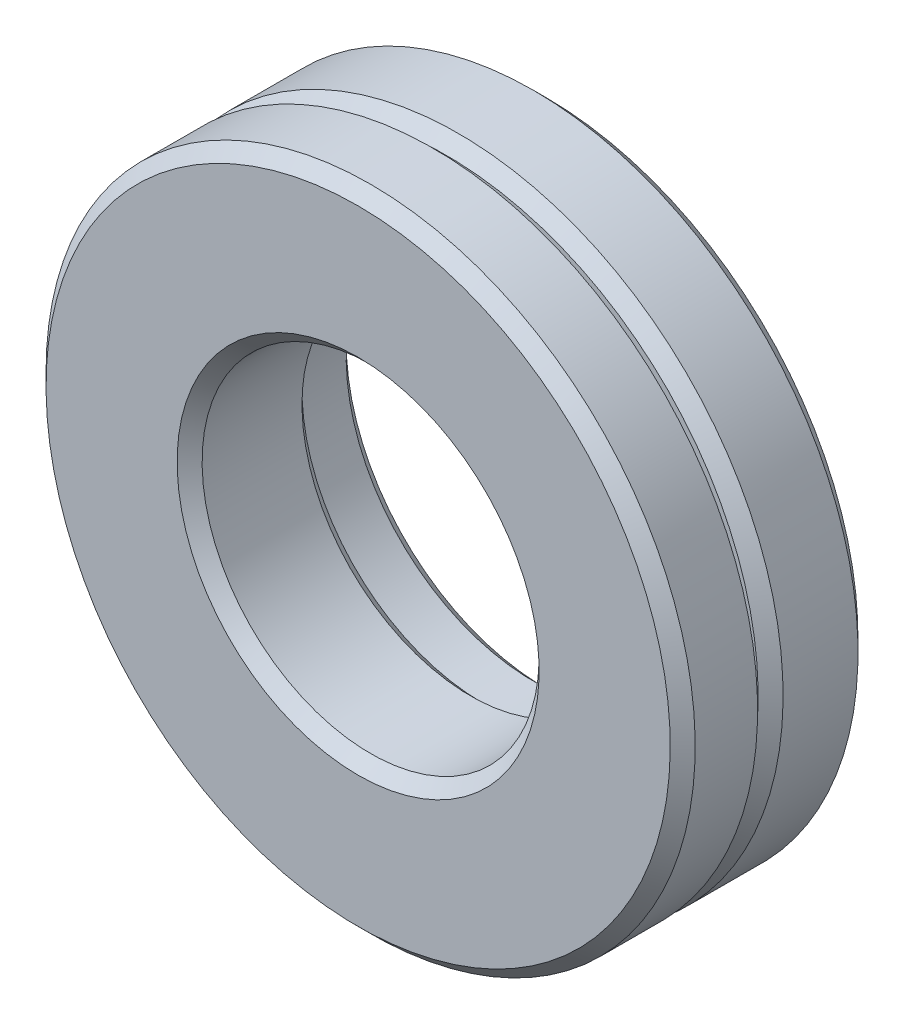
ISO-10303-21;
HEADER;
FILE_DESCRIPTION(('STEP AP214'),'2;1');
FILE_NAME('part.step','',(''),(''),'','','');
FILE_SCHEMA(('AUTOMOTIVE_DESIGN { 1 0 10303 214 1 1 1 1 }'));
ENDSEC;
DATA;
#1=APPLICATION_CONTEXT('core data for automotive mechanical design processes');
#2=APPLICATION_PROTOCOL_DEFINITION('international standard','automotive_design',2000,#1);
#3=PRODUCT_CONTEXT('',#1,'mechanical');
#4=PRODUCT('Part','Part','',(#3));
#5=PRODUCT_RELATED_PRODUCT_CATEGORY('part','',(#4));
#6=PRODUCT_DEFINITION_FORMATION('','',#4);
#7=PRODUCT_DEFINITION_CONTEXT('part definition',#1,'design');
#8=PRODUCT_DEFINITION('design','',#6,#7);
#9=PRODUCT_DEFINITION_SHAPE('','',#8);
#10=(LENGTH_UNIT() NAMED_UNIT(*) SI_UNIT(.MILLI.,.METRE.));
#11=(NAMED_UNIT(*) PLANE_ANGLE_UNIT() SI_UNIT($,.RADIAN.));
#12=(NAMED_UNIT(*) SI_UNIT($,.STERADIAN.) SOLID_ANGLE_UNIT());
#13=UNCERTAINTY_MEASURE_WITH_UNIT(LENGTH_MEASURE(1.E-05),#10,'distance_accuracy_value','');
#14=(GEOMETRIC_REPRESENTATION_CONTEXT(3) GLOBAL_UNCERTAINTY_ASSIGNED_CONTEXT((#13)) GLOBAL_UNIT_ASSIGNED_CONTEXT((#10,
#11,#12)) REPRESENTATION_CONTEXT('',''));
#15=CARTESIAN_POINT('',(0.,0.,0.));
#16=DIRECTION('',(0.,0.,1.));
#17=DIRECTION('',(1.,0.,0.));
#18=AXIS2_PLACEMENT_3D('',#15,#16,#17);
#19=CARTESIAN_POINT('',(0.,0.,0.));
#20=DIRECTION('',(0.,0.,1.));
#21=DIRECTION('',(1.,0.,0.));
#22=AXIS2_PLACEMENT_3D('',#19,#20,#21);
#23=CYLINDRICAL_SURFACE('',#22,11.1082830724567);
#24=CARTESIAN_POINT('',(0.,0.,3.69003801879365));
#25=DIRECTION('',(0.,0.,1.));
#26=DIRECTION('',(1.,0.,0.));
#27=AXIS2_PLACEMENT_3D('',#24,#25,#26);
#28=CIRCLE('',#27,11.1082830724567);
#29=CARTESIAN_POINT('',(-11.1082830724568,1.57515108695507E-13,3.69003801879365));
#30=VERTEX_POINT('',#29);
#31=EDGE_CURVE('E19',#30,#30,#28,.F.);
#32=ORIENTED_EDGE('',*,*,#31,.T.);
#33=EDGE_LOOP('',(#32));
#34=FACE_BOUND('',#33,.T.);
#35=CARTESIAN_POINT('',(0.,0.,3.67544158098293));
#36=DIRECTION('',(0.,0.,1.));
#37=DIRECTION('',(1.,0.,0.));
#38=AXIS2_PLACEMENT_3D('',#35,#36,#37);
#39=CIRCLE('',#38,11.1082830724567);
#40=CARTESIAN_POINT('',(11.1082830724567,0.,3.67544158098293));
#41=VERTEX_POINT('',#40);
#42=EDGE_CURVE('E114',#41,#41,#39,.T.);
#43=ORIENTED_EDGE('',*,*,#42,.T.);
#44=EDGE_LOOP('',(#43));
#45=FACE_BOUND('',#44,.T.);
#46=ADVANCED_FACE('F12',(#34,#45),#23,.T.);
#47=CARTESIAN_POINT('',(0.,0.,0.));
#48=DIRECTION('',(0.,0.,1.));
#49=DIRECTION('',(1.,0.,0.));
#50=AXIS2_PLACEMENT_3D('',#47,#48,#49);
#51=CYLINDRICAL_SURFACE('',#50,8.1090109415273);
#52=CARTESIAN_POINT('',(0.,0.,2.67440901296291));
#53=DIRECTION('',(0.,0.,1.));
#54=DIRECTION('',(1.,0.,0.));
#55=AXIS2_PLACEMENT_3D('',#52,#53,#54);
#56=CIRCLE('',#55,8.1090109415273);
#57=CARTESIAN_POINT('',(-8.10901094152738,1.57515108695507E-13,2.67440901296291));
#58=VERTEX_POINT('',#57);
#59=EDGE_CURVE('E31',#58,#58,#56,.F.);
#60=ORIENTED_EDGE('',*,*,#59,.F.);
#61=EDGE_LOOP('',(#60));
#62=FACE_BOUND('',#61,.T.);
#63=CARTESIAN_POINT('',(0.,0.,2.58379580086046));
#64=DIRECTION('',(0.,0.,1.));
#65=DIRECTION('',(1.,0.,0.));
#66=AXIS2_PLACEMENT_3D('',#63,#64,#65);
#67=CIRCLE('',#66,8.1090109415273);
#68=CARTESIAN_POINT('',(8.1090109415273,0.,2.58379580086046));
#69=VERTEX_POINT('',#68);
#70=EDGE_CURVE('E8',#69,#69,#67,.T.);
#71=ORIENTED_EDGE('',*,*,#70,.F.);
#72=EDGE_LOOP('',(#71));
#73=FACE_BOUND('',#72,.T.);
#74=ADVANCED_FACE('F74',(#62,#73),#51,.F.);
#75=CARTESIAN_POINT('',(-1.74319445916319E-13,1.57515108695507E-13,31.557690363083));
#76=DIRECTION('',(0.,0.,-1.));
#77=DIRECTION('',(-1.,0.,0.));
#78=AXIS2_PLACEMENT_3D('',#75,#76,#77);
#79=SPHERICAL_SURFACE('',#78,30.);
#80=CARTESIAN_POINT('',(-1.74319445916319E-13,1.57515108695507E-13,2.52067869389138));
#81=DIRECTION('',(0.,0.,-1.));
#82=DIRECTION('',(0.,-1.,0.));
#83=AXIS2_PLACEMENT_3D('',#80,#81,#82);
#84=CIRCLE('',#83,7.54002342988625);
#85=CARTESIAN_POINT('',(-7.54002342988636,1.57515108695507E-13,2.52067869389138));
#86=VERTEX_POINT('',#85);
#87=EDGE_CURVE('E48',#86,#86,#84,.T.);
#88=CARTESIAN_POINT('',(-7.54002342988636,1.57515108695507E-13,2.52067869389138));
#89=CARTESIAN_POINT('',(-7.5459659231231,1.57515108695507E-13,2.52222177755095));
#90=CARTESIAN_POINT('',(-7.55190794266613,1.57515108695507E-13,2.52376668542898));
#91=CARTESIAN_POINT('',(-7.56379103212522,1.57515108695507E-13,2.52686014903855));
#92=CARTESIAN_POINT('',(-7.56973210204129,1.57515108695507E-13,2.52840870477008));
#93=CARTESIAN_POINT('',(-7.58161329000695,1.57515108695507E-13,2.53150946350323));
#94=CARTESIAN_POINT('',(-7.58755340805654,1.57515108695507E-13,2.53306166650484));
#95=CARTESIAN_POINT('',(-7.59943269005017,1.57515108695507E-13,2.53616971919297));
#96=CARTESIAN_POINT('',(-7.60537185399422,1.57515108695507E-13,2.53772556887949));
#97=CARTESIAN_POINT('',(-7.61724922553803,1.57515108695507E-13,2.540840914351));
#98=CARTESIAN_POINT('',(-7.6231874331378,1.57515108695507E-13,2.54240041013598));
#99=CARTESIAN_POINT('',(-7.63506288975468,1.57515108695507E-13,2.54552304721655));
#100=CARTESIAN_POINT('',(-7.6410001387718,1.57515108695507E-13,2.54708618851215));
#101=CARTESIAN_POINT('',(-7.65287367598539,1.57515108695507E-13,2.55021611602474));
#102=CARTESIAN_POINT('',(-7.65880996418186,1.57515108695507E-13,2.55178290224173));
#103=CARTESIAN_POINT('',(-7.6706815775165,1.57515108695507E-13,2.55492011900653));
#104=CARTESIAN_POINT('',(-7.67661690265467,1.57515108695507E-13,2.55649054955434));
#105=CARTESIAN_POINT('',(-7.68848658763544,1.57515108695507E-13,2.55963505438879));
#106=CARTESIAN_POINT('',(-7.69442094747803,1.57515108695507E-13,2.56120912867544));
#107=CARTESIAN_POINT('',(-7.70628869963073,1.57515108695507E-13,2.56436092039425));
#108=CARTESIAN_POINT('',(-7.71222209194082,1.57515108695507E-13,2.56593863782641));
#109=CARTESIAN_POINT('',(-7.72408790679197,1.57515108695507E-13,2.56909771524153));
#110=CARTESIAN_POINT('',(-7.73002032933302,1.57515108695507E-13,2.57067907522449));
#111=CARTESIAN_POINT('',(-7.74188420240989,1.57515108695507E-13,2.57384543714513));
#112=CARTESIAN_POINT('',(-7.74781565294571,1.57515108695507E-13,2.5754304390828));
#113=CARTESIAN_POINT('',(-7.7596775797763,1.57515108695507E-13,2.57860408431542));
#114=CARTESIAN_POINT('',(-7.76560805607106,1.57515108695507E-13,2.58019272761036));
#115=CARTESIAN_POINT('',(-7.77746803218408,1.57515108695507E-13,2.58337365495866));
#116=CARTESIAN_POINT('',(-7.78339753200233,1.57515108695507E-13,2.58496593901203));
#117=CARTESIAN_POINT('',(-7.79525555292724,1.57515108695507E-13,2.588154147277));
#118=CARTESIAN_POINT('',(-7.8011840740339,1.57515108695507E-13,2.5897500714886));
#119=CARTESIAN_POINT('',(-7.81304013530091,1.57515108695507E-13,2.59294555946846));
#120=CARTESIAN_POINT('',(-7.81896767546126,1.57515108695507E-13,2.59454512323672));
#121=CARTESIAN_POINT('',(-7.83082177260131,1.57515108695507E-13,2.59774788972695));
#122=CARTESIAN_POINT('',(-7.836748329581,1.57515108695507E-13,2.59935109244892));
#123=CARTESIAN_POINT('',(-7.84860045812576,1.57515108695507E-13,2.60256113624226));
#124=CARTESIAN_POINT('',(-7.85452602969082,1.57515108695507E-13,2.60416797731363));
#125=CARTESIAN_POINT('',(-7.8663761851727,1.57515108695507E-13,2.60738529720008));
#126=CARTESIAN_POINT('',(-7.87230076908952,1.57515108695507E-13,2.60899577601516));
#127=CARTESIAN_POINT('',(-7.88414894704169,1.57515108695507E-13,2.61222037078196));
#128=CARTESIAN_POINT('',(-7.89007254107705,1.57515108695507E-13,2.61383448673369));
#129=CARTESIAN_POINT('',(-7.90191873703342,1.57515108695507E-13,2.61706635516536));
#130=CARTESIAN_POINT('',(-7.90784133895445,1.57515108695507E-13,2.61868410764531));
#131=CARTESIAN_POINT('',(-7.91968554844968,1.57515108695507E-13,2.62192324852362));
#132=CARTESIAN_POINT('',(-7.92560715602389,1.57515108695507E-13,2.62354463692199));
#133=CARTESIAN_POINT('',(-7.93744937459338,1.57515108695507E-13,2.62679104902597));
#134=CARTESIAN_POINT('',(-7.94336998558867,1.57515108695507E-13,2.62841607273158));
#135=CARTESIAN_POINT('',(-7.95521020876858,1.57515108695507E-13,2.63166975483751));
#136=CARTESIAN_POINT('',(-7.9611298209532,1.57515108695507E-13,2.63329841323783));
#137=CARTESIAN_POINT('',(-7.97296804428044,1.57515108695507E-13,2.63655936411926));
#138=CARTESIAN_POINT('',(-7.97888665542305,1.57515108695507E-13,2.63819165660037));
#139=CARTESIAN_POINT('',(-7.99072287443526,1.57515108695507E-13,2.6414598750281));
#140=CARTESIAN_POINT('',(-7.99664048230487,1.57515108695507E-13,2.64309580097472));
#141=CARTESIAN_POINT('',(-8.00847469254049,1.57515108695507E-13,2.64637128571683));
#142=CARTESIAN_POINT('',(-8.01439129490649,1.57515108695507E-13,2.64801084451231));
#143=CARTESIAN_POINT('',(-8.02622349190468,1.57515108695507E-13,2.65129359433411));
#144=CARTESIAN_POINT('',(-8.03213908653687,1.57515108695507E-13,2.65293678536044));
#145=CARTESIAN_POINT('',(-8.04396926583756,1.57515108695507E-13,2.65622679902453));
#146=CARTESIAN_POINT('',(-8.04988385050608,1.57515108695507E-13,2.65787362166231));
#147=CARTESIAN_POINT('',(-8.06171200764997,1.57515108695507E-13,2.66117089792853));
#148=CARTESIAN_POINT('',(-8.06762558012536,1.57515108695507E-13,2.66282135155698));
#149=CARTESIAN_POINT('',(-8.07945171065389,1.57515108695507E-13,2.6661258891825));
#150=CARTESIAN_POINT('',(-8.08536426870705,1.57515108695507E-13,2.66777997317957));
#151=CARTESIAN_POINT('',(-8.09718836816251,1.57515108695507E-13,2.67109177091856));
#152=CARTESIAN_POINT('',(-8.10309990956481,1.57515108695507E-13,2.67274948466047));
#153=CARTESIAN_POINT('',(-8.10901094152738,1.57515108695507E-13,2.67440901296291));
#154=B_SPLINE_CURVE_WITH_KNOTS('',3,(#88,#89,#90,#91,#92,#93,#94,#95,#96,#97,#98,#99,#100,#101,
#102,#103,#104,#105,#106,#107,#108,#109,#110,#111,#112,#113,#114,#115,#116,#117,#118,#119,#120,
#121,#122,#123,#124,#125,#126,#127,#128,#129,#130,#131,#132,#133,#134,#135,#136,#137,#138,#139,
#140,#141,#142,#143,#144,#145,#146,#147,#148,#149,#150,#151,#152,#153),.UNSPECIFIED.,.F.,.F.,(4,
2,2,2,2,2,2,2,2,2,2,2,2,2,2,2,2,2,2,2,2,2,2,2,2,2,2,2,2,2,2,2,4),(0.,0.0184187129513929,
0.0368374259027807,0.055256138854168,0.0736748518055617,0.0920935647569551,0.110512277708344,
0.12893099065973,0.147349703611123,0.165768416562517,0.184187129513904,0.202605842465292,
0.221024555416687,0.239443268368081,0.257861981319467,0.276280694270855,0.294699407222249,
0.313118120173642,0.331536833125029,0.349955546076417,0.368374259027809,0.386792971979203,
0.405211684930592,0.423630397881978,0.44204911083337,0.460467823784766,0.478886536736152,
0.497305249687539,0.515723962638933,0.534142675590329,0.552561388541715,0.570980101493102,
0.589398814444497),.UNSPECIFIED.);
#155=EDGE_CURVE('BSEAM80',#86,#58,#154,.T.);
#156=ORIENTED_EDGE('',*,*,#87,.F.);
#157=ORIENTED_EDGE('',*,*,#59,.T.);
#158=ORIENTED_EDGE('',*,*,#155,.T.);
#159=ORIENTED_EDGE('',*,*,#155,.F.);
#160=EDGE_LOOP('',(#156,#158,#157,#159));
#161=FACE_BOUND('',#160,.T.);
#162=ADVANCED_FACE('F80',(#161),#79,.T.);
#163=CARTESIAN_POINT('',(-1.74319445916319E-13,1.57515108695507E-13,2.52067869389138));
#164=DIRECTION('',(0.,0.,-1.));
#165=DIRECTION('',(0.,-1.,0.));
#166=AXIS2_PLACEMENT_3D('',#163,#164,#165);
#167=PLANE('',#166);
#168=CARTESIAN_POINT('',(-1.74319445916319E-13,1.57515108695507E-13,2.52067869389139));
#169=DIRECTION('',(0.,0.,1.));
#170=DIRECTION('',(0.,1.,0.));
#171=AXIS2_PLACEMENT_3D('',#168,#169,#170);
#172=CIRCLE('',#171,7.25);
#173=CARTESIAN_POINT('',(-1.74319445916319E-13,7.25000000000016,2.52067869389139));
#174=VERTEX_POINT('',#173);
#175=EDGE_CURVE('E42',#174,#174,#172,.T.);
#176=ORIENTED_EDGE('',*,*,#175,.T.);
#177=EDGE_LOOP('',(#176));
#178=FACE_BOUND('',#177,.T.);
#179=ORIENTED_EDGE('',*,*,#87,.T.);
#180=EDGE_LOOP('',(#179));
#181=FACE_BOUND('',#180,.T.);
#182=ADVANCED_FACE('F99',(#178,#181),#167,.T.);
#183=CARTESIAN_POINT('',(-1.74319445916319E-13,1.57515108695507E-13,4.52067869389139));
#184=DIRECTION('',(0.,0.,-1.));
#185=DIRECTION('',(0.,-1.,0.));
#186=AXIS2_PLACEMENT_3D('',#183,#184,#185);
#187=CIRCLE('',#186,13.);
#188=CARTESIAN_POINT('',(-13.0000000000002,1.57515108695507E-13,4.52067869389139));
#189=VERTEX_POINT('',#188);
#190=EDGE_CURVE('E45',#189,#189,#187,.T.);
#191=CARTESIAN_POINT('',(-11.1082830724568,1.57515108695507E-13,3.69003801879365));
#192=CARTESIAN_POINT('',(-11.1282786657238,1.57515108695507E-13,3.69800843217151));
#193=CARTESIAN_POINT('',(-11.148265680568,1.57515108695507E-13,3.70600036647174));
#194=CARTESIAN_POINT('',(-11.188222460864,1.57515108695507E-13,3.72202723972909));
#195=CARTESIAN_POINT('',(-11.2081922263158,1.57515108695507E-13,3.73006217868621));
#196=CARTESIAN_POINT('',(-11.2481144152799,1.57515108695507E-13,3.74617502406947));
#197=CARTESIAN_POINT('',(-11.2680668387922,1.57515108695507E-13,3.7542529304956));
#198=CARTESIAN_POINT('',(-11.3079542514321,1.57515108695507E-13,3.77045167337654));
#199=CARTESIAN_POINT('',(-11.3278892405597,1.57515108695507E-13,3.77857250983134));
#200=CARTESIAN_POINT('',(-11.3677416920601,1.57515108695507E-13,3.79485707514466));
#201=CARTESIAN_POINT('',(-11.3876591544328,1.57515108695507E-13,3.80302080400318));
#202=CARTESIAN_POINT('',(-11.4274764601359,1.57515108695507E-13,3.81939111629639));
#203=CARTESIAN_POINT('',(-11.4473763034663,1.57515108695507E-13,3.82759769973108));
#204=CARTESIAN_POINT('',(-11.4871582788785,1.57515108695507E-13,3.84405368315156));
#205=CARTESIAN_POINT('',(-11.5070404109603,1.57515108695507E-13,3.85230308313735));
#206=CARTESIAN_POINT('',(-11.5467868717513,1.57515108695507E-13,3.8688446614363));
#207=CARTESIAN_POINT('',(-11.5666512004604,1.57515108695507E-13,3.87713683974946));
#208=CARTESIAN_POINT('',(-11.6063619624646,1.57515108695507E-13,3.89376393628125));
#209=CARTESIAN_POINT('',(-11.6262083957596,1.57515108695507E-13,3.90209885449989));
#210=CARTESIAN_POINT('',(-11.6658832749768,1.57515108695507E-13,3.9188113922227));
#211=CARTESIAN_POINT('',(-11.6857117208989,1.57515108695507E-13,3.92718901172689));
#212=CARTESIAN_POINT('',(-11.725350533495,1.57515108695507E-13,3.943986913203));
#213=CARTESIAN_POINT('',(-11.745160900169,1.57515108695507E-13,3.95240719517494));
#214=CARTESIAN_POINT('',(-11.7847634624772,1.57515108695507E-13,3.96929038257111));
#215=CARTESIAN_POINT('',(-11.8045556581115,1.57515108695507E-13,3.97775328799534));
#216=CARTESIAN_POINT('',(-11.8441217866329,1.57515108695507E-13,3.99472168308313));
#217=CARTESIAN_POINT('',(-11.8638957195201,1.57515108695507E-13,4.00322717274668));
#218=CARTESIAN_POINT('',(-11.9034252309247,1.57515108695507E-13,4.02028069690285));
#219=CARTESIAN_POINT('',(-11.9231808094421,1.57515108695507E-13,4.02882873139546));
#220=CARTESIAN_POINT('',(-11.9626735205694,1.57515108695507E-13,4.04596730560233));
#221=CARTESIAN_POINT('',(-11.9824106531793,1.57515108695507E-13,4.05455784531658));
#222=CARTESIAN_POINT('',(-12.0218663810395,1.57515108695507E-13,4.07178139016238));
#223=CARTESIAN_POINT('',(-12.0415849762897,1.57515108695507E-13,4.08041439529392));
#224=CARTESIAN_POINT('',(-12.0810035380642,1.57515108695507E-13,4.09772283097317));
#225=CARTESIAN_POINT('',(-12.1007035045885,1.57515108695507E-13,4.10639826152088));
#226=CARTESIAN_POINT('',(-12.1400847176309,1.57515108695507E-13,4.12379150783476));
#227=CARTESIAN_POINT('',(-12.1597659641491,1.57515108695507E-13,4.13250932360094));
#228=CARTESIAN_POINT('',(-12.1991096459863,1.57515108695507E-13,4.14998729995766));
#229=CARTESIAN_POINT('',(-12.2187720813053,1.57515108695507E-13,4.15874746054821));
#230=CARTESIAN_POINT('',(-12.2580780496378,1.57515108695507E-13,4.17631008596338));
#231=CARTESIAN_POINT('',(-12.2777215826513,1.57515108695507E-13,4.18511255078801));
#232=CARTESIAN_POINT('',(-12.3169896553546,1.57515108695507E-13,4.20275974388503));
#233=CARTESIAN_POINT('',(-12.3366141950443,1.57515108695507E-13,4.21160447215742));
#234=CARTESIAN_POINT('',(-12.3758441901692,1.57515108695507E-13,4.22933615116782));
#235=CARTESIAN_POINT('',(-12.3954496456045,1.57515108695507E-13,4.23822310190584));
#236=CARTESIAN_POINT('',(-12.4346413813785,1.57515108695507E-13,4.25603918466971));
#237=CARTESIAN_POINT('',(-12.4542276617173,1.57515108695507E-13,4.26496831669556));
#238=CARTESIAN_POINT('',(-12.4933809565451,1.57515108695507E-13,4.28286872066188));
#239=CARTESIAN_POINT('',(-12.5129479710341,1.57515108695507E-13,4.29183999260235));
#240=CARTESIAN_POINT('',(-12.5520626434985,1.57515108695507E-13,4.30982463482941));
#241=CARTESIAN_POINT('',(-12.5716103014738,1.57515108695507E-13,4.31883800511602));
#242=CARTESIAN_POINT('',(-12.6106861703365,1.57515108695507E-13,4.33690680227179));
#243=CARTESIAN_POINT('',(-12.6302143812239,1.57515108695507E-13,4.34596222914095));
#244=CARTESIAN_POINT('',(-12.6692512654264,1.57515108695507E-13,4.3641150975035));
#245=CARTESIAN_POINT('',(-12.6887599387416,1.57515108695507E-13,4.37321253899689));
#246=CARTESIAN_POINT('',(-12.7277576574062,1.57515108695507E-13,4.39144939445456));
#247=CARTESIAN_POINT('',(-12.7472467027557,1.57515108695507E-13,4.40058880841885));
#248=CARTESIAN_POINT('',(-12.7862050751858,1.57515108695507E-13,4.41890956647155));
#249=CARTESIAN_POINT('',(-12.8056744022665,1.57515108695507E-13,4.42809091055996));
#250=CARTESIAN_POINT('',(-12.8445932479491,1.57515108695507E-13,4.44649548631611));
#251=CARTESIAN_POINT('',(-12.8640427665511,1.57515108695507E-13,4.45571871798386));
#252=CARTESIAN_POINT('',(-12.9029219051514,1.57515108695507E-13,4.4742070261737));
#253=CARTESIAN_POINT('',(-12.9223515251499,1.57515108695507E-13,4.48347210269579));
#254=CARTESIAN_POINT('',(-12.9611907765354,1.57515108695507E-13,4.50204405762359));
#255=CARTESIAN_POINT('',(-12.9806004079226,1.57515108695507E-13,4.51135093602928));
#256=CARTESIAN_POINT('',(-13.0000000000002,1.57515108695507E-13,4.52067869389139));
#257=B_SPLINE_CURVE_WITH_KNOTS('',3,(#191,#192,#193,#194,#195,#196,#197,#198,#199,#200,#201,
#202,#203,#204,#205,#206,#207,#208,#209,#210,#211,#212,#213,#214,#215,#216,#217,#218,#219,#220,
#221,#222,#223,#224,#225,#226,#227,#228,#229,#230,#231,#232,#233,#234,#235,#236,#237,#238,#239,
#240,#241,#242,#243,#244,#245,#246,#247,#248,#249,#250,#251,#252,#253,#254,#255,#256),
.UNSPECIFIED.,.F.,.F.,(4,2,2,2,2,2,2,2,2,2,2,2,2,2,2,2,2,2,2,2,2,2,2,2,2,2,2,2,2,2,2,2,4),(0.,
0.0645767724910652,0.129153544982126,0.193730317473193,0.258307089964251,0.322883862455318,
0.387460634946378,0.452037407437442,0.516614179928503,0.581190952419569,0.645767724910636,
0.710344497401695,0.774921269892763,0.83949804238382,0.904074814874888,0.968651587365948,
1.03322835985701,1.09780513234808,1.16238190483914,1.22695867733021,1.29153544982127,
1.35611222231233,1.42068899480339,1.48526576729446,1.54984253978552,1.61441931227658,
1.67899608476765,1.74357285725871,1.80814962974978,1.87272640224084,1.9373031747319,
2.00187994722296,2.06645671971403),.UNSPECIFIED.);
#258=EDGE_CURVE('BSEAM97',#30,#189,#257,.T.);
#259=ORIENTED_EDGE('',*,*,#31,.F.);
#260=ORIENTED_EDGE('',*,*,#190,.T.);
#261=ORIENTED_EDGE('',*,*,#258,.T.);
#262=ORIENTED_EDGE('',*,*,#258,.F.);
#263=EDGE_LOOP('',(#259,#261,#260,#262));
#264=FACE_BOUND('',#263,.T.);
#265=ADVANCED_FACE('F97',(#264),#79,.T.);
#266=CARTESIAN_POINT('',(-1.74319445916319E-13,1.57515108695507E-13,2.52067869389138));
#267=DIRECTION('',(0.,0.,-1.));
#268=DIRECTION('',(0.,-1.,0.));
#269=AXIS2_PLACEMENT_3D('',#266,#267,#268);
#270=CYLINDRICAL_SURFACE('',#269,13.);
#271=CARTESIAN_POINT('',(-1.74319445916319E-13,1.57515108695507E-13,7.02067869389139));
#272=DIRECTION('',(0.,0.,1.));
#273=DIRECTION('',(0.,1.,0.));
#274=AXIS2_PLACEMENT_3D('',#271,#272,#273);
#275=CIRCLE('',#274,13.);
#276=CARTESIAN_POINT('',(-1.74319445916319E-13,13.0000000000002,7.02067869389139));
#277=VERTEX_POINT('',#276);
#278=EDGE_CURVE('E28',#277,#277,#275,.F.);
#279=ORIENTED_EDGE('',*,*,#278,.T.);
#280=EDGE_LOOP('',(#279));
#281=FACE_BOUND('',#280,.T.);
#282=ORIENTED_EDGE('',*,*,#190,.F.);
#283=EDGE_LOOP('',(#282));
#284=FACE_BOUND('',#283,.T.);
#285=ADVANCED_FACE('F54',(#281,#284),#270,.T.);
#286=CARTESIAN_POINT('',(-1.74319445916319E-13,1.57515108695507E-13,7.52067869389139));
#287=DIRECTION('',(0.,0.,1.));
#288=DIRECTION('',(0.,1.,0.));
#289=AXIS2_PLACEMENT_3D('',#286,#287,#288);
#290=PLANE('',#289);
#291=CARTESIAN_POINT('',(-1.74319445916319E-13,1.57515108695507E-13,7.52067869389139));
#292=DIRECTION('',(0.,0.,1.));
#293=DIRECTION('',(0.,1.,0.));
#294=AXIS2_PLACEMENT_3D('',#291,#292,#293);
#295=CIRCLE('',#294,12.5);
#296=CARTESIAN_POINT('',(-1.74319445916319E-13,12.5000000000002,7.52067869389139));
#297=VERTEX_POINT('',#296);
#298=EDGE_CURVE('E23',#297,#297,#295,.T.);
#299=ORIENTED_EDGE('',*,*,#298,.T.);
#300=EDGE_LOOP('',(#299));
#301=FACE_BOUND('',#300,.T.);
#302=CARTESIAN_POINT('',(-1.74319445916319E-13,1.57515108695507E-13,7.52067869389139));
#303=DIRECTION('',(0.,0.,1.));
#304=DIRECTION('',(0.,1.,0.));
#305=AXIS2_PLACEMENT_3D('',#302,#303,#304);
#306=CIRCLE('',#305,7.25);
#307=CARTESIAN_POINT('',(-1.74319445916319E-13,7.25000000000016,7.52067869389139));
#308=VERTEX_POINT('',#307);
#309=EDGE_CURVE('E33',#308,#308,#306,.T.);
#310=ORIENTED_EDGE('',*,*,#309,.F.);
#311=EDGE_LOOP('',(#310));
#312=FACE_BOUND('',#311,.T.);
#313=ADVANCED_FACE('F59',(#301,#312),#290,.T.);
#314=CARTESIAN_POINT('',(-1.74319445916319E-13,1.57515108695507E-13,7.02067869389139));
#315=DIRECTION('',(0.,0.,-1.));
#316=DIRECTION('',(0.,-1.,0.));
#317=AXIS2_PLACEMENT_3D('',#314,#315,#316);
#318=CONICAL_SURFACE('',#317,13.,0.785398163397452);
#319=ORIENTED_EDGE('',*,*,#298,.F.);
#320=EDGE_LOOP('',(#319));
#321=FACE_BOUND('',#320,.T.);
#322=ORIENTED_EDGE('',*,*,#278,.F.);
#323=EDGE_LOOP('',(#322));
#324=FACE_BOUND('',#323,.T.);
#325=ADVANCED_FACE('F14',(#321,#324),#318,.T.);
#326=CARTESIAN_POINT('',(-1.74319445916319E-13,1.57515108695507E-13,3.02067869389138));
#327=DIRECTION('',(0.,0.,-1.));
#328=DIRECTION('',(0.,-1.,0.));
#329=AXIS2_PLACEMENT_3D('',#326,#327,#328);
#330=CONICAL_SURFACE('',#329,6.75,0.785398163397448);
#331=ORIENTED_EDGE('',*,*,#175,.F.);
#332=EDGE_LOOP('',(#331));
#333=FACE_BOUND('',#332,.T.);
#334=CARTESIAN_POINT('',(-1.74319445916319E-13,1.57515108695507E-13,3.02067869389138));
#335=DIRECTION('',(0.,0.,1.));
#336=DIRECTION('',(0.,1.,0.));
#337=AXIS2_PLACEMENT_3D('',#334,#335,#336);
#338=CIRCLE('',#337,6.75);
#339=CARTESIAN_POINT('',(-1.74319445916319E-13,6.75000000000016,3.02067869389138));
#340=VERTEX_POINT('',#339);
#341=EDGE_CURVE('E39',#340,#340,#338,.T.);
#342=ORIENTED_EDGE('',*,*,#341,.T.);
#343=EDGE_LOOP('',(#342));
#344=FACE_BOUND('',#343,.T.);
#345=ADVANCED_FACE('F58',(#333,#344),#330,.F.);
#346=CARTESIAN_POINT('',(-1.74319445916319E-13,1.57515108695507E-13,7.52067869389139));
#347=DIRECTION('',(0.,0.,1.));
#348=DIRECTION('',(0.,1.,0.));
#349=AXIS2_PLACEMENT_3D('',#346,#347,#348);
#350=CYLINDRICAL_SURFACE('',#349,6.75);
#351=ORIENTED_EDGE('',*,*,#341,.F.);
#352=EDGE_LOOP('',(#351));
#353=FACE_BOUND('',#352,.T.);
#354=CARTESIAN_POINT('',(-1.74319445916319E-13,1.57515108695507E-13,7.02067869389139));
#355=DIRECTION('',(0.,0.,1.));
#356=DIRECTION('',(0.,1.,0.));
#357=AXIS2_PLACEMENT_3D('',#354,#355,#356);
#358=CIRCLE('',#357,6.75);
#359=CARTESIAN_POINT('',(-1.74319445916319E-13,6.75000000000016,7.02067869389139));
#360=VERTEX_POINT('',#359);
#361=EDGE_CURVE('E36',#360,#360,#358,.T.);
#362=ORIENTED_EDGE('',*,*,#361,.T.);
#363=EDGE_LOOP('',(#362));
#364=FACE_BOUND('',#363,.T.);
#365=ADVANCED_FACE('F67',(#353,#364),#350,.F.);
#366=CARTESIAN_POINT('',(-1.74319445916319E-13,1.57515108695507E-13,7.52067869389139));
#367=DIRECTION('',(0.,0.,1.));
#368=DIRECTION('',(0.,1.,0.));
#369=AXIS2_PLACEMENT_3D('',#366,#367,#368);
#370=CONICAL_SURFACE('',#369,7.25,0.785398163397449);
#371=ORIENTED_EDGE('',*,*,#361,.F.);
#372=EDGE_LOOP('',(#371));
#373=FACE_BOUND('',#372,.T.);
#374=ORIENTED_EDGE('',*,*,#309,.T.);
#375=EDGE_LOOP('',(#374));
#376=FACE_BOUND('',#375,.T.);
#377=ADVANCED_FACE('F87',(#373,#376),#370,.F.);
#378=CARTESIAN_POINT('',(0.,0.,0.5));
#379=DIRECTION('',(0.,0.,-1.));
#380=DIRECTION('',(0.,-1.,0.));
#381=AXIS2_PLACEMENT_3D('',#378,#379,#380);
#382=CONICAL_SURFACE('',#381,7.5,0.785398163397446);
#383=CARTESIAN_POINT('',(0.,0.,0.));
#384=DIRECTION('',(0.,0.,1.));
#385=DIRECTION('',(0.,1.,0.));
#386=AXIS2_PLACEMENT_3D('',#383,#384,#385);
#387=CIRCLE('',#386,8.);
#388=CARTESIAN_POINT('',(0.,8.,0.));
#389=VERTEX_POINT('',#388);
#390=EDGE_CURVE('E129',#389,#389,#387,.T.);
#391=ORIENTED_EDGE('',*,*,#390,.F.);
#392=EDGE_LOOP('',(#391));
#393=FACE_BOUND('',#392,.T.);
#394=CARTESIAN_POINT('',(0.,0.,0.5));
#395=DIRECTION('',(0.,0.,1.));
#396=DIRECTION('',(0.,1.,0.));
#397=AXIS2_PLACEMENT_3D('',#394,#395,#396);
#398=CIRCLE('',#397,7.5);
#399=CARTESIAN_POINT('',(0.,7.5,0.5));
#400=VERTEX_POINT('',#399);
#401=EDGE_CURVE('E119',#400,#400,#398,.T.);
#402=ORIENTED_EDGE('',*,*,#401,.T.);
#403=EDGE_LOOP('',(#402));
#404=FACE_BOUND('',#403,.T.);
#405=ADVANCED_FACE('F90',(#393,#404),#382,.F.);
#406=CARTESIAN_POINT('',(0.,0.,4.));
#407=DIRECTION('',(0.,0.,1.));
#408=DIRECTION('',(0.,1.,0.));
#409=AXIS2_PLACEMENT_3D('',#406,#407,#408);
#410=CYLINDRICAL_SURFACE('',#409,7.5);
#411=ORIENTED_EDGE('',*,*,#401,.F.);
#412=EDGE_LOOP('',(#411));
#413=FACE_BOUND('',#412,.T.);
#414=CARTESIAN_POINT('',(0.,0.,2.36213394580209));
#415=DIRECTION('',(0.,0.,1.));
#416=DIRECTION('',(0.,1.,0.));
#417=AXIS2_PLACEMENT_3D('',#414,#415,#416);
#418=CIRCLE('',#417,7.5);
#419=CARTESIAN_POINT('',(0.,7.5,2.36213394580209));
#420=VERTEX_POINT('',#419);
#421=EDGE_CURVE('E116',#420,#420,#418,.T.);
#422=ORIENTED_EDGE('',*,*,#421,.T.);
#423=EDGE_LOOP('',(#422));
#424=FACE_BOUND('',#423,.T.);
#425=ADVANCED_FACE('F169',(#413,#424),#410,.F.);
#426=CARTESIAN_POINT('',(0.,0.,4.));
#427=DIRECTION('',(0.,0.,1.));
#428=DIRECTION('',(0.,1.,0.));
#429=AXIS2_PLACEMENT_3D('',#426,#427,#428);
#430=CONICAL_SURFACE('',#429,12.,1.22173047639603);
#431=ORIENTED_EDGE('',*,*,#421,.F.);
#432=EDGE_LOOP('',(#431));
#433=FACE_BOUND('',#432,.T.);
#434=ORIENTED_EDGE('',*,*,#70,.T.);
#435=EDGE_LOOP('',(#434));
#436=FACE_BOUND('',#435,.T.);
#437=ADVANCED_FACE('F173',(#433,#436),#430,.F.);
#438=ORIENTED_EDGE('',*,*,#42,.F.);
#439=EDGE_LOOP('',(#438));
#440=FACE_BOUND('',#439,.T.);
#441=CARTESIAN_POINT('',(0.,0.,4.));
#442=DIRECTION('',(0.,0.,1.));
#443=DIRECTION('',(0.,1.,0.));
#444=AXIS2_PLACEMENT_3D('',#441,#442,#443);
#445=CIRCLE('',#444,12.);
#446=CARTESIAN_POINT('',(0.,12.,4.));
#447=VERTEX_POINT('',#446);
#448=EDGE_CURVE('E122',#447,#447,#445,.T.);
#449=ORIENTED_EDGE('',*,*,#448,.T.);
#450=EDGE_LOOP('',(#449));
#451=FACE_BOUND('',#450,.T.);
#452=ADVANCED_FACE('F163',(#440,#451),#430,.F.);
#453=CARTESIAN_POINT('',(0.,0.,4.));
#454=DIRECTION('',(0.,0.,-1.));
#455=DIRECTION('',(0.,-1.,0.));
#456=AXIS2_PLACEMENT_3D('',#453,#454,#455);
#457=PLANE('',#456);
#458=ORIENTED_EDGE('',*,*,#448,.F.);
#459=EDGE_LOOP('',(#458));
#460=FACE_BOUND('',#459,.T.);
#461=CARTESIAN_POINT('',(0.,0.,4.));
#462=DIRECTION('',(0.,0.,-1.));
#463=DIRECTION('',(0.,-1.,0.));
#464=AXIS2_PLACEMENT_3D('',#461,#462,#463);
#465=CIRCLE('',#464,12.5);
#466=CARTESIAN_POINT('',(0.,-12.5,4.));
#467=VERTEX_POINT('',#466);
#468=EDGE_CURVE('E124',#467,#467,#465,.F.);
#469=ORIENTED_EDGE('',*,*,#468,.T.);
#470=EDGE_LOOP('',(#469));
#471=FACE_BOUND('',#470,.T.);
#472=ADVANCED_FACE('F143',(#460,#471),#457,.F.);
#473=CARTESIAN_POINT('',(0.,0.,0.));
#474=DIRECTION('',(0.,0.,-1.));
#475=DIRECTION('',(0.,-1.,0.));
#476=AXIS2_PLACEMENT_3D('',#473,#474,#475);
#477=CYLINDRICAL_SURFACE('',#476,13.);
#478=CARTESIAN_POINT('',(0.,0.,0.499999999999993));
#479=DIRECTION('',(0.,0.,1.));
#480=DIRECTION('',(0.,1.,0.));
#481=AXIS2_PLACEMENT_3D('',#478,#479,#480);
#482=CIRCLE('',#481,13.);
#483=CARTESIAN_POINT('',(0.,13.,0.499999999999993));
#484=VERTEX_POINT('',#483);
#485=EDGE_CURVE('E137',#484,#484,#482,.T.);
#486=ORIENTED_EDGE('',*,*,#485,.T.);
#487=EDGE_LOOP('',(#486));
#488=FACE_BOUND('',#487,.T.);
#489=CARTESIAN_POINT('',(0.,0.,3.5));
#490=DIRECTION('',(0.,0.,-1.));
#491=DIRECTION('',(0.,-1.,0.));
#492=AXIS2_PLACEMENT_3D('',#489,#490,#491);
#493=CIRCLE('',#492,13.);
#494=CARTESIAN_POINT('',(0.,-13.,3.5));
#495=VERTEX_POINT('',#494);
#496=EDGE_CURVE('E132',#495,#495,#493,.T.);
#497=ORIENTED_EDGE('',*,*,#496,.T.);
#498=EDGE_LOOP('',(#497));
#499=FACE_BOUND('',#498,.T.);
#500=ADVANCED_FACE('F152',(#488,#499),#477,.T.);
#501=CARTESIAN_POINT('',(0.,0.,0.));
#502=DIRECTION('',(0.,0.,1.));
#503=DIRECTION('',(0.,1.,0.));
#504=AXIS2_PLACEMENT_3D('',#501,#502,#503);
#505=CONICAL_SURFACE('',#504,12.5,0.785398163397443);
#506=ORIENTED_EDGE('',*,*,#485,.F.);
#507=EDGE_LOOP('',(#506));
#508=FACE_BOUND('',#507,.T.);
#509=CARTESIAN_POINT('',(0.,0.,0.));
#510=DIRECTION('',(0.,0.,1.));
#511=DIRECTION('',(0.,1.,0.));
#512=AXIS2_PLACEMENT_3D('',#509,#510,#511);
#513=CIRCLE('',#512,12.5);
#514=CARTESIAN_POINT('',(0.,12.5,0.));
#515=VERTEX_POINT('',#514);
#516=EDGE_CURVE('E128',#515,#515,#513,.F.);
#517=ORIENTED_EDGE('',*,*,#516,.F.);
#518=EDGE_LOOP('',(#517));
#519=FACE_BOUND('',#518,.T.);
#520=ADVANCED_FACE('F148',(#508,#519),#505,.T.);
#521=CARTESIAN_POINT('',(0.,0.,3.5));
#522=DIRECTION('',(0.,0.,-1.));
#523=DIRECTION('',(0.,-1.,0.));
#524=AXIS2_PLACEMENT_3D('',#521,#522,#523);
#525=CONICAL_SURFACE('',#524,13.,0.78539816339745);
#526=ORIENTED_EDGE('',*,*,#468,.F.);
#527=EDGE_LOOP('',(#526));
#528=FACE_BOUND('',#527,.T.);
#529=ORIENTED_EDGE('',*,*,#496,.F.);
#530=EDGE_LOOP('',(#529));
#531=FACE_BOUND('',#530,.T.);
#532=ADVANCED_FACE('F145',(#528,#531),#525,.T.);
#533=CARTESIAN_POINT('',(0.,0.,0.));
#534=DIRECTION('',(0.,0.,1.));
#535=DIRECTION('',(1.,0.,0.));
#536=AXIS2_PLACEMENT_3D('',#533,#534,#535);
#537=PLANE('',#536);
#538=ORIENTED_EDGE('',*,*,#390,.T.);
#539=EDGE_LOOP('',(#538));
#540=FACE_BOUND('',#539,.T.);
#541=ORIENTED_EDGE('',*,*,#516,.T.);
#542=EDGE_LOOP('',(#541));
#543=FACE_BOUND('',#542,.T.);
#544=ADVANCED_FACE('F86',(#540,#543),#537,.F.);
#545=CLOSED_SHELL('',(#46,#74,#162,#182,#265,#285,#313,#325,#345,#365,#377,#405,#425,#437,#452,
#472,#500,#520,#532,#544));
#546=MANIFOLD_SOLID_BREP('B1',#545);
#547=ADVANCED_BREP_SHAPE_REPRESENTATION('',(#18,#546),#14);
#548=SHAPE_DEFINITION_REPRESENTATION(#9,#547);
ENDSEC;
END-ISO-10303-21;
